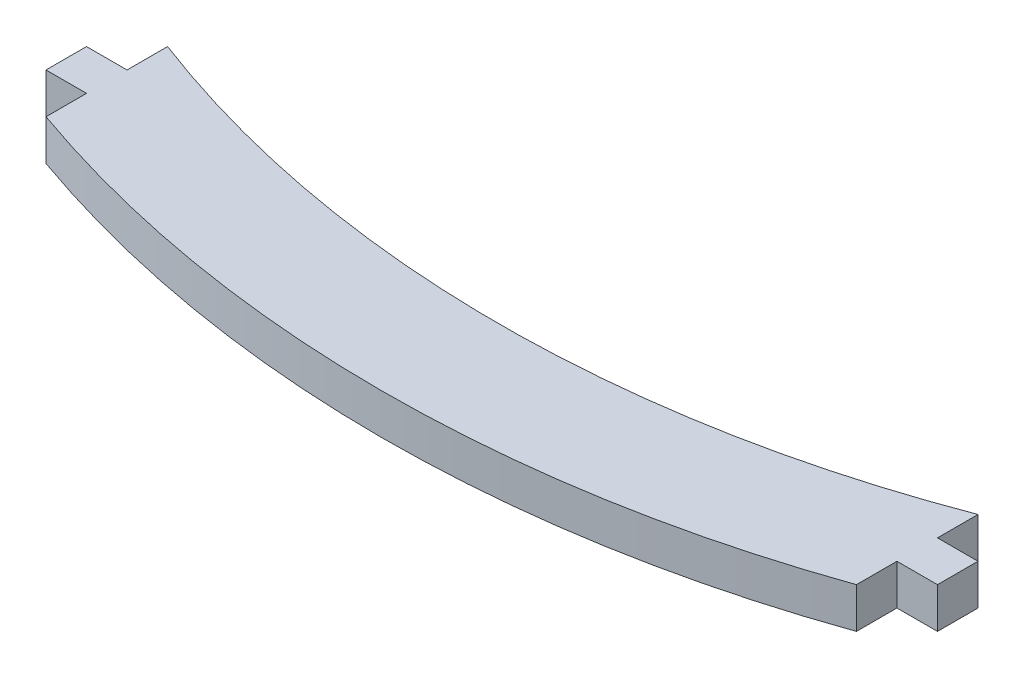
from build123d import *

# Parameters (mm, degrees)
BOSS_EXTRUDE1_DEPTH = 3
SKETCH2_W           = 3
SKETCH2_H           = 3
BOSS_EXTRUDE2_DEPTH = 3


with BuildPart() as part:
    # Sketch1 → Boss-Extrude1 (new body)
    with BuildSketch(Plane(origin=(0, 0, 0), x_dir=(1, 0, 0), z_dir=(0, 1, 0))):
        with BuildLine():
            Line((-30, 0), (-30, 9))
            ThreePointArc((-30, 9), (0, 3.485958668), (30, 9))
            Line((30, 9), (30, 0))
            ThreePointArc((30, 0), (0, -5.147186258), (-30, 0))
        make_face()
    extrude(amount=BOSS_EXTRUDE1_DEPTH)

    # Sketch2 → Boss-Extrude2 (add)
    with BuildSketch(Plane(origin=(0, 0, 0), x_dir=(1, 0, 0), z_dir=(0, 1, 0))):
        with Locations((-31.5, 4.5)):
            Rectangle(SKETCH2_W, SKETCH2_H)
        with Locations((31.5, 4.5)):
            Rectangle(SKETCH2_W, SKETCH2_H)
    extrude(amount=BOSS_EXTRUDE2_DEPTH)


solid = part.part
